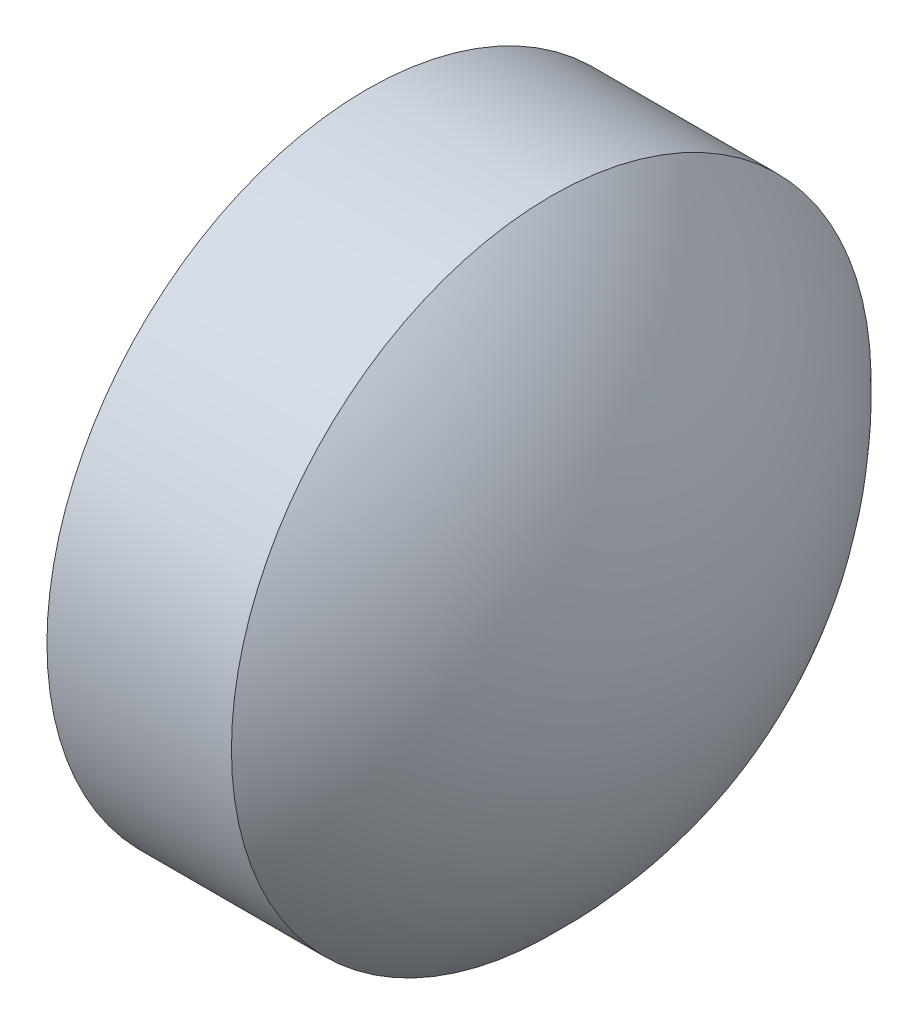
from build123d import *


with BuildPart() as part:
    # Skizze1 → Rotation1 (revolve)
    with BuildSketch(Plane.XY.offset(8)):
        with BuildLine():
            Line((43.550024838, 1.75), (42.540423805, 1.75))
            ThreePointArc((42.540423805, 1.75), (42.17124284, 0.909387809), (42.045, 0))
            Line((42.045, 0), (44.305, 0))
            ThreePointArc((44.305, 0), (44.108207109, 0.952954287), (43.550024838, 1.75))
        make_face()
    revolve(axis=Axis((0, 0, 8), (1, 0, 0)))


solid = part.part
